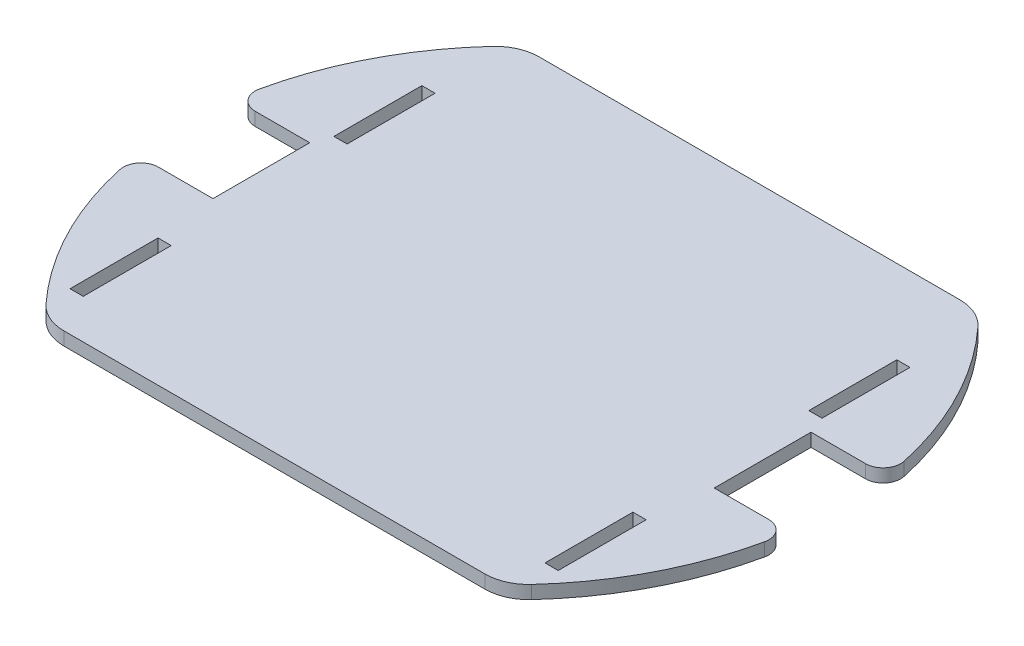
from build123d import *

# Parameters (mm, degrees)
BOSS_EXTRUDE1_DEPTH = 3
SKETCH2_W           = 3
SKETCH2_H           = 20
CUT_EXTRUDE3_DEPTH  = 10
FILLET1_R           = 10
FILLET2_R           = 4


with BuildPart() as part:
    # Sketch1 → Boss-Extrude1 (new body)
    with BuildSketch(Plane(origin=(0, 0, 0), x_dir=(1, 0, 0), z_dir=(0, 1, 0))):
        with BuildLine():
            Line((-52.048054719, 54), (52.048054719, 54))
            ThreePointArc((52.048054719, 54), (66.679796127, 34.33372669), (74.188947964, 11))
            Line((74.188947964, 11), (57, 11))
            Line((57, 11), (57, -11))
            Line((57, -11), (74.188947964, -11))
            ThreePointArc((74.188947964, -11), (66.679796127, -34.33372669), (52.048054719, -54))
            Line((52.048054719, -54), (-52.048054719, -54))
            ThreePointArc((-52.048054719, -54), (-66.679796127, -34.33372669), (-74.188947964, -11))
            Line((-74.188947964, -11), (-57, -11))
            Line((-57, -11), (-57, 11))
            Line((-57, 11), (-74.188947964, 11))
            ThreePointArc((-74.188947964, 11), (-66.679796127, 34.33372669), (-52.048054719, 54))
        make_face()
    extrude(amount=BOSS_EXTRUDE1_DEPTH)

    # Sketch2 → Cut-Extrude3 (cut)
    with BuildSketch(Plane(origin=(0, 3, 0), x_dir=(1, 0, 0), z_dir=(0, 1, 0))):
        with Locations((54, 25)):
            Rectangle(SKETCH2_W, SKETCH2_H)
        with Locations((54, -35)):
            Rectangle(SKETCH2_W, SKETCH2_H)
        with Locations((-54, 25)):
            Rectangle(SKETCH2_W, SKETCH2_H)
        with Locations((-54, -35)):
            Rectangle(SKETCH2_W, SKETCH2_H)
    extrude(amount=-CUT_EXTRUDE3_DEPTH, mode=Mode.SUBTRACT)

    # Fillet1
    fillet1_edges = [part.edges().sort_by_distance(p)[0] for p in [
        (52.048054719, 1.5, 54),
        (-52.048054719, 1.5, 54),
        (-52.048054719, 1.5, -54),
        (52.048054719, 1.5, -54),
    ]]
    fillet(fillet1_edges, radius=FILLET1_R)

    # Fillet2
    fillet2_edges = [part.edges().sort_by_distance(p)[0] for p in [
        (74.188947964, 1.5, -11),
        (74.188947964, 1.5, 11),
        (-74.188947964, 1.5, 11),
        (-74.188947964, 1.5, -11),
    ]]
    fillet(fillet2_edges, radius=FILLET2_R)


solid = part.part
